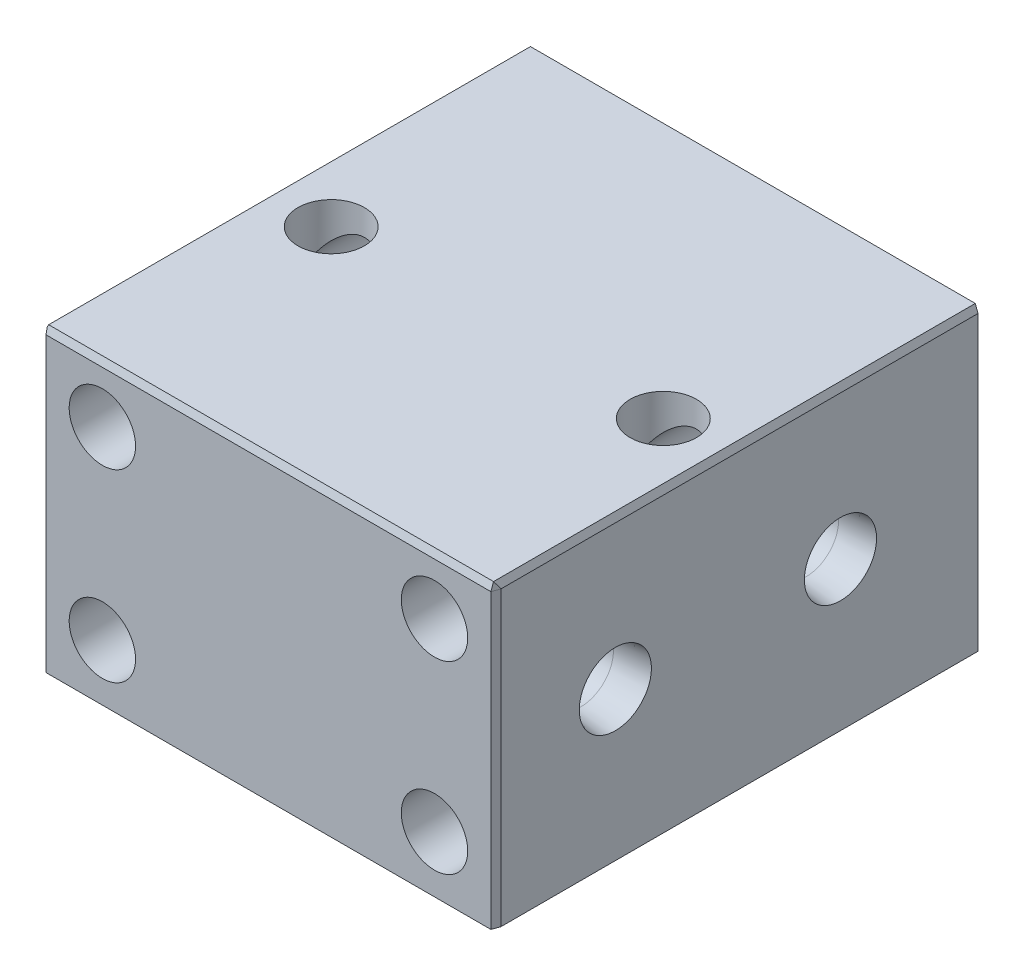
from build123d import *
from OCP.BRepFilletAPI import BRepFilletAPI_MakeChamfer

# Parameters (mm, degrees)
SKETCH1_W                    = 61
SKETCH1_H                    = 41
BOSS_EXTRUDE1_DEPTH          = 66
SKETCH2_R                    = 6
CUT_EXTRUDE1_DEPTH           = 50
SKETCH3_R                    = 4.5
CUT_EXTRUDE2_DEPTH           = 76.541379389
SKETCH4_R                    = 4.5
CUT_EXTRUDE3_DEPTH           = 84.470054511
G1_8_TAPPED_HOLE1_AT_2_COUNT = 2
G1_8_TAPPED_HOLE1_AT_2_PITCH = 30.5
SKETCH9_R                    = 5
CUT_EXTRUDE4_DEPTH           = 1.3
CHAMFER1_SIZE                = 1
CHAMFER1_SIZE2               = 0.363970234
CHAMFER2_SIZE                = 1
CHAMFER2_SIZE2               = 0.363970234


with BuildPart() as part:
    # Sketch1 → Boss-Extrude1 (new body)
    with BuildSketch(Plane.XY):
        Rectangle(SKETCH1_W, SKETCH1_H)
    extrude(amount=BOSS_EXTRUDE1_DEPTH)

    # Sketch2 → Cut-Extrude1 (cut)
    with BuildSketch(Plane(origin=(0, 0, 0), x_dir=(-1, 0, 0), z_dir=(0, 0, -1))):
        Circle(SKETCH2_R)
    extrude(amount=-CUT_EXTRUDE1_DEPTH, mode=Mode.SUBTRACT)

    # Sketch3 → Cut-Extrude2 (cut, through all)
    with BuildSketch(Plane(origin=(0, 0, 0), x_dir=(-1, 0, 0), z_dir=(0, 0, -1))):
        with Locations((-22.5, 12.5)):
            Circle(SKETCH3_R)
        with Locations((-22.5, -12.5)):
            Circle(SKETCH3_R)
        with Locations((22.5, 12.5)):
            Circle(SKETCH3_R)
        with Locations((22.5, -12.5)):
            Circle(SKETCH3_R)
    extrude(amount=-CUT_EXTRUDE2_DEPTH, mode=Mode.SUBTRACT)

    # Sketch4 → Cut-Extrude3 (cut, through all)
    with BuildSketch(Plane(origin=(0, 20.5, 0), x_dir=(1, 0, 0), z_dir=(0, 1, 0))):
        with Locations(Location((-22.5, -35, 0), (0, 0, 270))):
            Circle(SKETCH4_R)
        with Locations((22.5, -35)):
            Circle(SKETCH4_R)
    extrude(amount=-CUT_EXTRUDE3_DEPTH, mode=Mode.SUBTRACT)

    # Sketch8 → G1_8 Tapped Hole1 (revolve, cut)
    with BuildSketch(Plane(origin=(30.5, 0, 19), x_dir=(0, 0, -1), z_dir=(0, 1, 0))):
        Polygon((0, 0), (0, 15.643786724), (4.4, 13), (4.4, 4.652524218), (4.889, 0), align=None)
    g1_8_tapped_hole1 = revolve(axis=Axis((36.85, 0, 19), (-1, 0, 0)), mode=Mode.SUBTRACT)

    # G1_8 Tapped Hole1 at 2: G1_8 Tapped Hole1 ×2
    with Locations(*[(0, 0, i * G1_8_TAPPED_HOLE1_AT_2_PITCH) for i in range(1, G1_8_TAPPED_HOLE1_AT_2_COUNT)]):
        add(g1_8_tapped_hole1, mode=Mode.SUBTRACT)

    # Sketch9 → Cut-Extrude4 (cut)
    with BuildSketch(Plane.XZ.offset(20.5)):
        with Locations(Location((0, 49.5, 0), (0, 0, 270))):
            Circle(SKETCH9_R)
        with Locations(Location((0, 19, 0), (0, 0, 270))):
            Circle(SKETCH9_R)
    extrude(amount=-CUT_EXTRUDE4_DEPTH, mode=Mode.SUBTRACT)

    # Chamfer1: one chamfer whose edges measure the first distance from different faces: ONE call of the kernel's chamfer builder (chamfer() names one face for all edges)
    chamfer1_edges_1 = [part.edges().sort_by_distance(p)[0] for p in [
        (-30.5, 20.5, 33),
        (-30.5, -20.5, 33),
    ]]
    chamfer1_side_1 = [part.faces().sort_by_distance(p)[0] for p in [
        (-30.5, 0, 33),
    ]]
    chamfer1_edges_2 = [part.edges().sort_by_distance(p)[0] for p in [
        (0, 20.5, 0),
        (30.5, 0, 0),
        (0, -20.5, 0),
    ]]
    chamfer1_side_2 = [part.faces().sort_by_distance(p)[0] for p in [
        (0, 19.765017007, 0),
    ]]
    chamfer1_edges_3 = [part.edges().sort_by_distance(p)[0] for p in [
        (0, 20.5, 66),
    ]]
    chamfer1_side_3 = [part.faces().sort_by_distance(p)[0] for p in [
        (0, 0, 66),
    ]]
    chamfer1_edges_4 = [part.edges().sort_by_distance(p)[0] for p in [
        (30.5, 20.5, 33),
        (30.5, 0, 66),
    ]]
    chamfer1_side_4 = [part.faces().sort_by_distance(p)[0] for p in [
        (30.5, 0, 32.926548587),
    ]]
    chamfer1_edges_5 = [part.edges().sort_by_distance(p)[0] for p in [
        (0, -20.5, 66),
        (30.5, -20.5, 33),
    ]]
    chamfer1_side_5 = [part.faces().sort_by_distance(p)[0] for p in [
        (0, -20.5, 32.879514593),
    ]]
    chamfer1 = BRepFilletAPI_MakeChamfer(part.part.solid().wrapped)
    for e in chamfer1_edges_1:
        chamfer1.Add(CHAMFER1_SIZE, CHAMFER1_SIZE2, e.wrapped, chamfer1_side_1[0].wrapped)  # the first distance lies on this face
    for e in chamfer1_edges_2:
        chamfer1.Add(CHAMFER1_SIZE, CHAMFER1_SIZE2, e.wrapped, chamfer1_side_2[0].wrapped)  # the first distance lies on this face
    for e in chamfer1_edges_3:
        chamfer1.Add(CHAMFER1_SIZE, CHAMFER1_SIZE2, e.wrapped, chamfer1_side_3[0].wrapped)  # the first distance lies on this face
    for e in chamfer1_edges_4:
        chamfer1.Add(CHAMFER1_SIZE, CHAMFER1_SIZE2, e.wrapped, chamfer1_side_4[0].wrapped)  # the first distance lies on this face
    for e in chamfer1_edges_5:
        chamfer1.Add(CHAMFER1_SIZE, CHAMFER1_SIZE2, e.wrapped, chamfer1_side_5[0].wrapped)  # the first distance lies on this face
    add(Compound.cast(chamfer1.Shape()), mode=Mode.REPLACE)

    # Chamfer2: one chamfer whose edges measure the first distance from different faces: ONE call of the kernel's chamfer builder (chamfer() names one face for all edges)
    chamfer2_edges_1 = [part.edges().sort_by_distance(p)[0] for p in [
        (-30.5, 0, 66),
    ]]
    chamfer2_side_1 = [part.faces().sort_by_distance(p)[0] for p in [
        (-30.5, 0, 33),
    ]]
    chamfer2_edges_2 = [part.edges().sort_by_distance(p)[0] for p in [
        (-30.5, 0, 0),
    ]]
    chamfer2_side_2 = [part.faces().sort_by_distance(p)[0] for p in [
        (-29.784388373, 0, 0),
    ]]
    chamfer2 = BRepFilletAPI_MakeChamfer(part.part.solid().wrapped)
    for e in chamfer2_edges_1:
        chamfer2.Add(CHAMFER2_SIZE, CHAMFER2_SIZE2, e.wrapped, chamfer2_side_1[0].wrapped)  # the first distance lies on this face
    for e in chamfer2_edges_2:
        chamfer2.Add(CHAMFER2_SIZE, CHAMFER2_SIZE2, e.wrapped, chamfer2_side_2[0].wrapped)  # the first distance lies on this face
    add(Compound.cast(chamfer2.Shape()), mode=Mode.REPLACE)


solid = part.part
